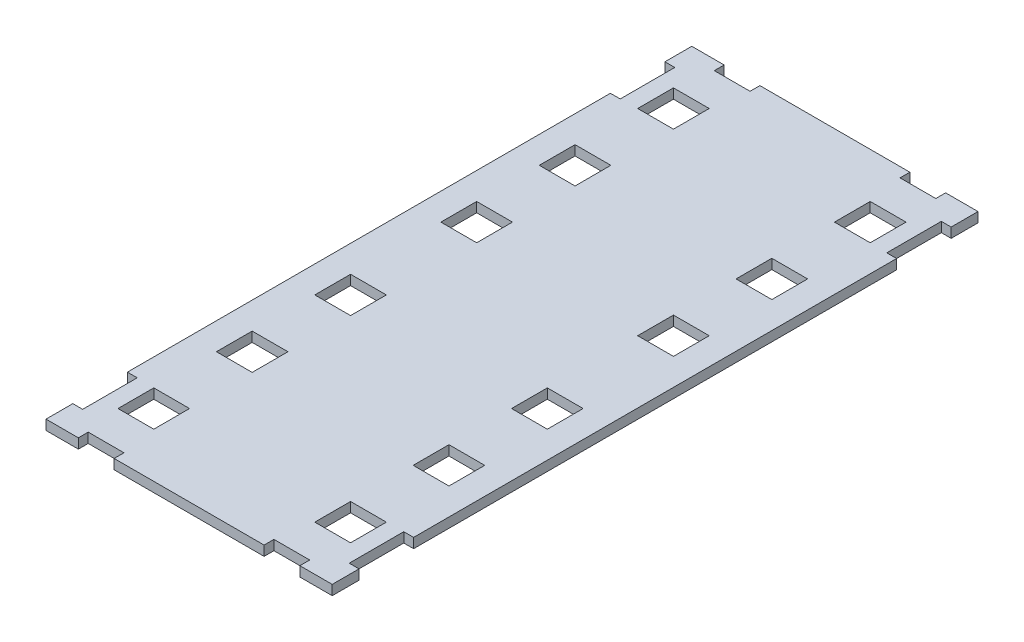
from build123d import *

# Parameters (mm, degrees)
SALIENTE_EXTRUIR1_DEPTH = 5.5
CROQUIS4_W              = 20
CROQUIS4_H              = 20
CORTAR_EXTRUIR3_DEPTH   = 10


with BuildPart() as part:
    # Croquis2 → Saliente-Extruir1 (new body)
    with BuildSketch(Plane(origin=(0, 0, 0), x_dir=(1, 0, 0), z_dir=(0, 1, 0))):
        Polygon((0, 140.5), (0, 321), (41.914280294, 321), (41.914280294, 315.5), (61.914280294, 315.5), (61.914280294, 321), (80, 321), (80, 306), (74.5, 306), (74.5, 275.5), (80, 275.5), (80, 140.5), align=None)
    extrude(amount=SALIENTE_EXTRUIR1_DEPTH)

    # Croquis4 → Cortar-Extruir3 (cut)
    with BuildSketch(Plane(origin=(0, 0, 0), x_dir=(1, 0, 0), z_dir=(0, 1, 0))):
        with Locations((55, 285.75)):
            Rectangle(CROQUIS4_W, CROQUIS4_H)
        with Locations((55, 230.75)):
            Rectangle(CROQUIS4_W, CROQUIS4_H)
        with Locations((55, 175.75)):
            Rectangle(CROQUIS4_W, CROQUIS4_H)
    extrude(amount=CORTAR_EXTRUIR3_DEPTH, mode=Mode.SUBTRACT)

    # Simetr_a3: part across plane


with BuildPart() as part_1:
    add(part.part)
    add(part.part.mirror(Plane(origin=(0, 5.5, 0), x_dir=(0, 0, 1), z_dir=(-1, 0, 0))))

    # Simetr_a4: part across plane


with BuildPart() as part_2:
    add(part_1.part)
    add(part_1.part.mirror(Plane(origin=(0, 5.5, -140.5), x_dir=(1, 0, 0), z_dir=(0, 0, -1))))


solid = part_2.part
